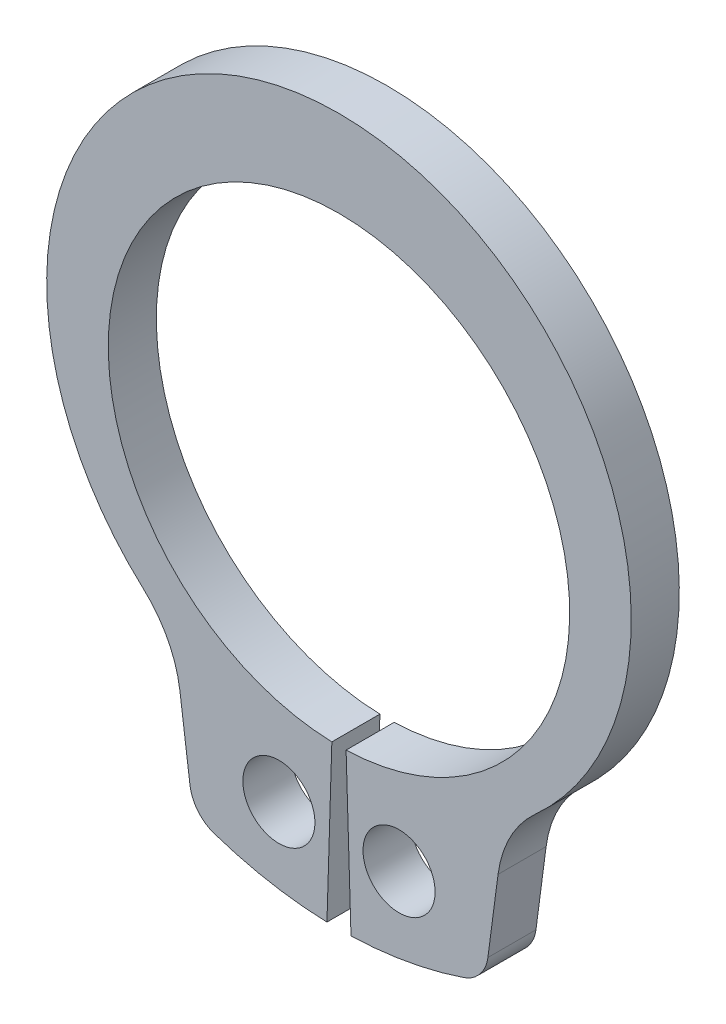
from build123d import *

# Parameters (mm, degrees)
BODYSKE_R  = 0.75
BODY_DEPTH = 1


with BuildPart() as part:
    # BodySke → Body (new body)
    with BuildSketch(Plane.XY):
        with BuildLine():
            Line((0.148148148, -4.797713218), (0.25, -8.096141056))
            ThreePointArc((0.25, -8.096141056), (1.438202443, -7.971296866), (2.595115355, -7.673029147))
            ThreePointArc((2.595115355, -7.673029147), (2.934319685, -7.438681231), (3.098410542, -7.06045813))
            Line((3.098410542, -7.06045813), (3.309651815, -5.455921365))
            ThreePointArc((3.309651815, -5.455921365), (3.563633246, -4.655004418), (4.078421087, -3.990950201))
            ThreePointArc((4.078421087, -3.990950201), (0, 6.6), (-4.078421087, -3.990950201))
            ThreePointArc((-4.078421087, -3.990950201), (-3.563633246, -4.655004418), (-3.309651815, -5.455921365))
            Line((-3.309651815, -5.455921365), (-3.098410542, -7.06045813))
            ThreePointArc((-3.098410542, -7.06045813), (-2.934319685, -7.438681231), (-2.595115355, -7.673029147))
            ThreePointArc((-2.595115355, -7.673029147), (-1.438202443, -7.971296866), (-0.25, -8.096141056))
            Line((-0.25, -8.096141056), (-0.148148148, -4.797713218))
            ThreePointArc((-0.148148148, -4.797713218), (0, 4.8), (0.148148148, -4.797713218))
        make_face()
        with Locations((1.25, -6.429618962)):
            Circle(BODYSKE_R, mode=Mode.SUBTRACT)
        with Locations((-1.25, -6.429618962)):
            Circle(BODYSKE_R, mode=Mode.SUBTRACT)
    extrude(amount=-BODY_DEPTH)


solid = part.part
